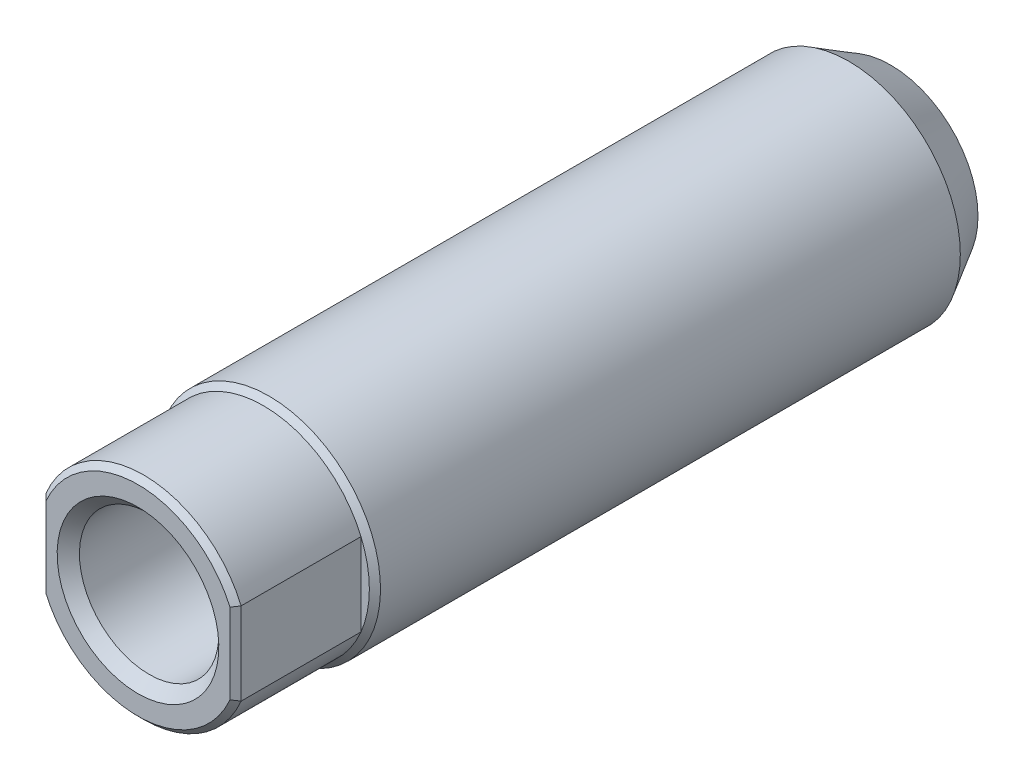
ISO-10303-21;
HEADER;
FILE_DESCRIPTION(('STEP AP214'),'2;1');
FILE_NAME('part.step','',(''),(''),'','','');
FILE_SCHEMA(('AUTOMOTIVE_DESIGN { 1 0 10303 214 1 1 1 1 }'));
ENDSEC;
DATA;
#1=APPLICATION_CONTEXT('core data for automotive mechanical design processes');
#2=APPLICATION_PROTOCOL_DEFINITION('international standard','automotive_design',2000,#1);
#3=PRODUCT_CONTEXT('',#1,'mechanical');
#4=PRODUCT('Part','Part','',(#3));
#5=PRODUCT_RELATED_PRODUCT_CATEGORY('part','',(#4));
#6=PRODUCT_DEFINITION_FORMATION('','',#4);
#7=PRODUCT_DEFINITION_CONTEXT('part definition',#1,'design');
#8=PRODUCT_DEFINITION('design','',#6,#7);
#9=PRODUCT_DEFINITION_SHAPE('','',#8);
#10=(LENGTH_UNIT() NAMED_UNIT(*) SI_UNIT(.MILLI.,.METRE.));
#11=(NAMED_UNIT(*) PLANE_ANGLE_UNIT() SI_UNIT($,.RADIAN.));
#12=(NAMED_UNIT(*) SI_UNIT($,.STERADIAN.) SOLID_ANGLE_UNIT());
#13=UNCERTAINTY_MEASURE_WITH_UNIT(LENGTH_MEASURE(1.E-05),#10,'distance_accuracy_value','');
#14=(GEOMETRIC_REPRESENTATION_CONTEXT(3) GLOBAL_UNCERTAINTY_ASSIGNED_CONTEXT((#13)) GLOBAL_UNIT_ASSIGNED_CONTEXT((#10,
#11,#12)) REPRESENTATION_CONTEXT('',''));
#15=CARTESIAN_POINT('',(0.,0.,0.));
#16=DIRECTION('',(0.,0.,1.));
#17=DIRECTION('',(1.,0.,0.));
#18=AXIS2_PLACEMENT_3D('',#15,#16,#17);
#19=CARTESIAN_POINT('',(0.,0.,27.));
#20=DIRECTION('',(0.,0.,-1.));
#21=DIRECTION('',(0.,1.,0.));
#22=AXIS2_PLACEMENT_3D('',#19,#20,#21);
#23=CYLINDRICAL_SURFACE('',#22,4.);
#24=CARTESIAN_POINT('',(0.,0.,1.5));
#25=DIRECTION('',(0.,0.,1.));
#26=DIRECTION('',(0.,-1.,0.));
#27=AXIS2_PLACEMENT_3D('',#24,#25,#26);
#28=CIRCLE('',#27,4.);
#29=CARTESIAN_POINT('',(0.,-4.,1.5));
#30=VERTEX_POINT('',#29);
#31=EDGE_CURVE('E23',#30,#30,#28,.T.);
#32=ORIENTED_EDGE('',*,*,#31,.T.);
#33=EDGE_LOOP('',(#32));
#34=FACE_BOUND('',#33,.T.);
#35=CARTESIAN_POINT('',(0.,0.,22.3));
#36=DIRECTION('',(0.,0.,-1.));
#37=DIRECTION('',(0.,1.,0.));
#38=AXIS2_PLACEMENT_3D('',#35,#36,#37);
#39=CIRCLE('',#38,4.);
#40=CARTESIAN_POINT('',(0.,4.,22.3));
#41=VERTEX_POINT('',#40);
#42=EDGE_CURVE('E100',#41,#41,#39,.T.);
#43=ORIENTED_EDGE('',*,*,#42,.T.);
#44=EDGE_LOOP('',(#43));
#45=FACE_BOUND('',#44,.T.);
#46=ADVANCED_FACE('F14',(#34,#45),#23,.T.);
#47=CARTESIAN_POINT('',(0.,0.,0.));
#48=DIRECTION('',(0.,0.,1.));
#49=DIRECTION('',(0.,-1.,0.));
#50=AXIS2_PLACEMENT_3D('',#47,#48,#49);
#51=PLANE('',#50);
#52=CARTESIAN_POINT('',(0.,0.,0.));
#53=DIRECTION('',(0.,0.,1.));
#54=DIRECTION('',(0.,-1.,0.));
#55=AXIS2_PLACEMENT_3D('',#52,#53,#54);
#56=CIRCLE('',#55,3.13397459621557);
#57=CARTESIAN_POINT('',(0.,-3.13397459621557,0.));
#58=VERTEX_POINT('',#57);
#59=EDGE_CURVE('E9',#58,#58,#56,.F.);
#60=ORIENTED_EDGE('',*,*,#59,.T.);
#61=EDGE_LOOP('',(#60));
#62=FACE_BOUND('',#61,.T.);
#63=ADVANCED_FACE('F183',(#62),#51,.F.);
#64=CARTESIAN_POINT('',(0.,0.,22.5));
#65=DIRECTION('',(0.,0.,-1.));
#66=DIRECTION('',(0.,1.,0.));
#67=AXIS2_PLACEMENT_3D('',#64,#65,#66);
#68=CONICAL_SURFACE('',#67,3.8,0.785398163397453);
#69=CARTESIAN_POINT('',(0.,0.,22.5));
#70=DIRECTION('',(0.,0.,-1.));
#71=DIRECTION('',(0.,1.,0.));
#72=AXIS2_PLACEMENT_3D('',#69,#70,#71);
#73=CIRCLE('',#72,3.8);
#74=CARTESIAN_POINT('',(3.5,1.47986485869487,22.5));
#75=VERTEX_POINT('',#74);
#76=CARTESIAN_POINT('',(3.5,-1.47986485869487,22.5));
#77=VERTEX_POINT('',#76);
#78=EDGE_CURVE('E74',#75,#77,#73,.T.);
#79=ORIENTED_EDGE('',*,*,#78,.T.);
#80=CARTESIAN_POINT('',(-3.5,-1.47986485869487,22.5));
#81=VERTEX_POINT('',#80);
#82=EDGE_CURVE('E91',#77,#81,#73,.T.);
#83=ORIENTED_EDGE('',*,*,#82,.T.);
#84=CARTESIAN_POINT('',(-3.5,1.47986485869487,22.5));
#85=VERTEX_POINT('',#84);
#86=EDGE_CURVE('E85',#81,#85,#73,.T.);
#87=ORIENTED_EDGE('',*,*,#86,.T.);
#88=EDGE_CURVE('E70',#85,#75,#73,.T.);
#89=ORIENTED_EDGE('',*,*,#88,.T.);
#90=EDGE_LOOP('',(#79,#83,#87,#89));
#91=FACE_BOUND('',#90,.T.);
#92=ORIENTED_EDGE('',*,*,#42,.F.);
#93=EDGE_LOOP('',(#92));
#94=FACE_BOUND('',#93,.T.);
#95=ADVANCED_FACE('F80',(#91,#94),#68,.T.);
#96=CARTESIAN_POINT('',(0.,0.,0.));
#97=DIRECTION('',(0.,0.,-1.));
#98=DIRECTION('',(0.,1.,0.));
#99=AXIS2_PLACEMENT_3D('',#96,#97,#98);
#100=CYLINDRICAL_SURFACE('',#99,3.8);
#101=DIRECTION('',(0.,0.,-1.));
#102=VECTOR('',#101,1.);
#103=CARTESIAN_POINT('',(3.5,-1.47986485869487,0.));
#104=LINE('',#103,#102);
#105=CARTESIAN_POINT('',(3.5,-1.47986485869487,26.8));
#106=VERTEX_POINT('',#105);
#107=EDGE_CURVE('E73',#106,#77,#104,.T.);
#108=ORIENTED_EDGE('',*,*,#107,.F.);
#109=CARTESIAN_POINT('',(0.,0.,26.8));
#110=DIRECTION('',(0.,0.,1.));
#111=DIRECTION('',(0.,-1.,0.));
#112=AXIS2_PLACEMENT_3D('',#109,#110,#111);
#113=CIRCLE('',#112,3.8);
#114=CARTESIAN_POINT('',(-3.5,-1.47986485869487,26.8));
#115=VERTEX_POINT('',#114);
#116=EDGE_CURVE('E118',#106,#115,#113,.F.);
#117=ORIENTED_EDGE('',*,*,#116,.T.);
#118=DIRECTION('',(0.,0.,-1.));
#119=VECTOR('',#118,1.);
#120=CARTESIAN_POINT('',(-3.5,-1.47986485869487,0.));
#121=LINE('',#120,#119);
#122=EDGE_CURVE('E97',#81,#115,#121,.F.);
#123=ORIENTED_EDGE('',*,*,#122,.F.);
#124=ORIENTED_EDGE('',*,*,#82,.F.);
#125=EDGE_LOOP('',(#108,#117,#123,#124));
#126=FACE_BOUND('',#125,.T.);
#127=ADVANCED_FACE('F210',(#126),#100,.T.);
#128=DIRECTION('',(0.,0.,-1.));
#129=VECTOR('',#128,1.);
#130=CARTESIAN_POINT('',(-3.5,1.47986485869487,0.));
#131=LINE('',#130,#129);
#132=CARTESIAN_POINT('',(-3.5,1.47986485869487,26.8));
#133=VERTEX_POINT('',#132);
#134=EDGE_CURVE('E94',#133,#85,#131,.T.);
#135=ORIENTED_EDGE('',*,*,#134,.F.);
#136=CARTESIAN_POINT('',(0.,0.,26.8));
#137=DIRECTION('',(0.,0.,1.));
#138=DIRECTION('',(0.,-1.,0.));
#139=AXIS2_PLACEMENT_3D('',#136,#137,#138);
#140=CIRCLE('',#139,3.8);
#141=CARTESIAN_POINT('',(3.5,1.47986485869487,26.8));
#142=VERTEX_POINT('',#141);
#143=EDGE_CURVE('E30',#133,#142,#140,.F.);
#144=ORIENTED_EDGE('',*,*,#143,.T.);
#145=DIRECTION('',(0.,0.,-1.));
#146=VECTOR('',#145,1.);
#147=CARTESIAN_POINT('',(3.5,1.47986485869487,0.));
#148=LINE('',#147,#146);
#149=EDGE_CURVE('E67',#75,#142,#148,.F.);
#150=ORIENTED_EDGE('',*,*,#149,.F.);
#151=ORIENTED_EDGE('',*,*,#88,.F.);
#152=EDGE_LOOP('',(#135,#144,#150,#151));
#153=FACE_BOUND('',#152,.T.);
#154=ADVANCED_FACE('F69',(#153),#100,.T.);
#155=CARTESIAN_POINT('',(3.5,5.,27.5));
#156=DIRECTION('',(-1.,0.,0.));
#157=DIRECTION('',(0.,0.,-1.));
#158=AXIS2_PLACEMENT_3D('',#155,#156,#157);
#159=PLANE('',#158);
#160=ORIENTED_EDGE('',*,*,#149,.T.);
#161=DIRECTION('',(0.,-1.,0.));
#162=VECTOR('',#161,1.);
#163=CARTESIAN_POINT('',(3.5,-1.47986485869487,26.8));
#164=LINE('',#163,#162);
#165=EDGE_CURVE('E37',#142,#106,#164,.T.);
#166=ORIENTED_EDGE('',*,*,#165,.T.);
#167=ORIENTED_EDGE('',*,*,#107,.T.);
#168=DIRECTION('',(0.,-1.,0.));
#169=VECTOR('',#168,1.);
#170=CARTESIAN_POINT('',(3.5,5.,22.5));
#171=LINE('',#170,#169);
#172=EDGE_CURVE('E90',#75,#77,#171,.T.);
#173=ORIENTED_EDGE('',*,*,#172,.F.);
#174=EDGE_LOOP('',(#160,#166,#167,#173));
#175=FACE_BOUND('',#174,.T.);
#176=ADVANCED_FACE('F92',(#175),#159,.F.);
#177=CARTESIAN_POINT('',(3.5,5.,22.5));
#178=DIRECTION('',(0.,0.,-1.));
#179=DIRECTION('',(0.,1.,0.));
#180=AXIS2_PLACEMENT_3D('',#177,#178,#179);
#181=PLANE('',#180);
#182=ORIENTED_EDGE('',*,*,#172,.T.);
#183=ORIENTED_EDGE('',*,*,#78,.F.);
#184=EDGE_LOOP('',(#182,#183));
#185=FACE_BOUND('',#184,.T.);
#186=ADVANCED_FACE('F89',(#185),#181,.F.);
#187=CARTESIAN_POINT('',(-3.5,5.,27.5));
#188=DIRECTION('',(1.,0.,0.));
#189=DIRECTION('',(0.,0.,1.));
#190=AXIS2_PLACEMENT_3D('',#187,#188,#189);
#191=PLANE('',#190);
#192=ORIENTED_EDGE('',*,*,#122,.T.);
#193=DIRECTION('',(0.,1.,0.));
#194=VECTOR('',#193,1.);
#195=CARTESIAN_POINT('',(-3.5,1.47986485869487,26.8));
#196=LINE('',#195,#194);
#197=EDGE_CURVE('E106',#115,#133,#196,.T.);
#198=ORIENTED_EDGE('',*,*,#197,.T.);
#199=ORIENTED_EDGE('',*,*,#134,.T.);
#200=DIRECTION('',(0.,-1.,0.));
#201=VECTOR('',#200,1.);
#202=CARTESIAN_POINT('',(-3.5,5.,22.5));
#203=LINE('',#202,#201);
#204=EDGE_CURVE('E95',#85,#81,#203,.T.);
#205=ORIENTED_EDGE('',*,*,#204,.T.);
#206=EDGE_LOOP('',(#192,#198,#199,#205));
#207=FACE_BOUND('',#206,.T.);
#208=ADVANCED_FACE('F201',(#207),#191,.F.);
#209=CARTESIAN_POINT('',(-4.5,5.,22.5));
#210=DIRECTION('',(0.,0.,-1.));
#211=DIRECTION('',(0.,1.,0.));
#212=AXIS2_PLACEMENT_3D('',#209,#210,#211);
#213=PLANE('',#212);
#214=ORIENTED_EDGE('',*,*,#204,.F.);
#215=ORIENTED_EDGE('',*,*,#86,.F.);
#216=EDGE_LOOP('',(#214,#215));
#217=FACE_BOUND('',#216,.T.);
#218=ADVANCED_FACE('F195',(#217),#213,.F.);
#219=CARTESIAN_POINT('',(0.,0.,27.));
#220=DIRECTION('',(0.,0.,1.));
#221=DIRECTION('',(0.,-1.,0.));
#222=AXIS2_PLACEMENT_3D('',#219,#220,#221);
#223=PLANE('',#222);
#224=CARTESIAN_POINT('',(0.,0.,27.));
#225=DIRECTION('',(0.,0.,1.));
#226=DIRECTION('',(0.,-1.,0.));
#227=AXIS2_PLACEMENT_3D('',#224,#225,#226);
#228=CIRCLE('',#227,3.6);
#229=CARTESIAN_POINT('',(3.3,1.43874945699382,27.));
#230=VERTEX_POINT('',#229);
#231=CARTESIAN_POINT('',(-3.3,1.43874945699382,27.));
#232=VERTEX_POINT('',#231);
#233=EDGE_CURVE('E109',#230,#232,#228,.T.);
#234=ORIENTED_EDGE('',*,*,#233,.T.);
#235=DIRECTION('',(0.,-1.,0.));
#236=VECTOR('',#235,1.);
#237=CARTESIAN_POINT('',(-3.3,-1.47986485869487,27.));
#238=LINE('',#237,#236);
#239=CARTESIAN_POINT('',(-3.3,-1.43874945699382,27.));
#240=VERTEX_POINT('',#239);
#241=EDGE_CURVE('E115',#232,#240,#238,.T.);
#242=ORIENTED_EDGE('',*,*,#241,.T.);
#243=CARTESIAN_POINT('',(0.,0.,27.));
#244=DIRECTION('',(0.,0.,1.));
#245=DIRECTION('',(0.,-1.,0.));
#246=AXIS2_PLACEMENT_3D('',#243,#244,#245);
#247=CIRCLE('',#246,3.6);
#248=CARTESIAN_POINT('',(3.3,-1.43874945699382,27.));
#249=VERTEX_POINT('',#248);
#250=EDGE_CURVE('E113',#240,#249,#247,.T.);
#251=ORIENTED_EDGE('',*,*,#250,.T.);
#252=DIRECTION('',(0.,1.,0.));
#253=VECTOR('',#252,1.);
#254=CARTESIAN_POINT('',(3.3,1.47986485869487,27.));
#255=LINE('',#254,#253);
#256=EDGE_CURVE('E111',#249,#230,#255,.T.);
#257=ORIENTED_EDGE('',*,*,#256,.T.);
#258=EDGE_LOOP('',(#234,#242,#251,#257));
#259=FACE_BOUND('',#258,.T.);
#260=CARTESIAN_POINT('',(0.,0.,27.));
#261=DIRECTION('',(0.,0.,1.));
#262=DIRECTION('',(0.,-1.,0.));
#263=AXIS2_PLACEMENT_3D('',#260,#261,#262);
#264=CIRCLE('',#263,2.9);
#265=CARTESIAN_POINT('',(0.,-2.9,27.));
#266=VERTEX_POINT('',#265);
#267=EDGE_CURVE('E86',#266,#266,#264,.T.);
#268=ORIENTED_EDGE('',*,*,#267,.F.);
#269=EDGE_LOOP('',(#268));
#270=FACE_BOUND('',#269,.T.);
#271=ADVANCED_FACE('F191',(#259,#270),#223,.T.);
#272=CARTESIAN_POINT('',(0.,0.,27.));
#273=DIRECTION('',(0.,0.,1.));
#274=DIRECTION('',(0.,-1.,0.));
#275=AXIS2_PLACEMENT_3D('',#272,#273,#274);
#276=CONICAL_SURFACE('',#275,2.9,0.78539816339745);
#277=CARTESIAN_POINT('',(0.,0.,26.6));
#278=DIRECTION('',(0.,0.,1.));
#279=DIRECTION('',(0.,-1.,0.));
#280=AXIS2_PLACEMENT_3D('',#277,#278,#279);
#281=CIRCLE('',#280,2.5);
#282=CARTESIAN_POINT('',(0.,-2.5,26.6));
#283=VERTEX_POINT('',#282);
#284=EDGE_CURVE('E18',#283,#283,#281,.F.);
#285=ORIENTED_EDGE('',*,*,#284,.T.);
#286=EDGE_LOOP('',(#285));
#287=FACE_BOUND('',#286,.T.);
#288=ORIENTED_EDGE('',*,*,#267,.T.);
#289=EDGE_LOOP('',(#288));
#290=FACE_BOUND('',#289,.T.);
#291=ADVANCED_FACE('F194',(#287,#290),#276,.F.);
#292=CARTESIAN_POINT('',(3.5,5.,26.8));
#293=DIRECTION('',(0.707106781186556,0.,0.707106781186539));
#294=DIRECTION('',(-0.707106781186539,0.,0.707106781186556));
#295=AXIS2_PLACEMENT_3D('',#292,#293,#294);
#296=PLANE('',#295);
#297=CARTESIAN_POINT('',(3.3,1.43874945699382,27.));
#298=CARTESIAN_POINT('',(3.33332361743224,1.44569655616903,26.9666763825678));
#299=CARTESIAN_POINT('',(3.36665209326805,1.45259638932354,26.933347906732));
#300=CARTESIAN_POINT('',(3.43331875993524,1.46630152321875,26.8666812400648));
#301=CARTESIAN_POINT('',(3.4666569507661,1.4731068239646,26.8333430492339));
#302=CARTESIAN_POINT('',(3.5,1.47986485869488,26.8));
#303=B_SPLINE_CURVE_WITH_KNOTS('',3,(#297,#298,#299,#300,#301,#302),.UNSPECIFIED.,.F.,.F.,(4,2,
4),(0.,0.142907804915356,0.285815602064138),.UNSPECIFIED.);
#304=EDGE_CURVE('E160',#230,#142,#303,.T.);
#305=ORIENTED_EDGE('',*,*,#304,.F.);
#306=ORIENTED_EDGE('',*,*,#256,.F.);
#307=CARTESIAN_POINT('',(3.3,-1.43874945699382,27.));
#308=CARTESIAN_POINT('',(3.33332361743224,-1.44569655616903,26.9666763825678));
#309=CARTESIAN_POINT('',(3.36665209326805,-1.45259638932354,26.933347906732));
#310=CARTESIAN_POINT('',(3.43331875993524,-1.46630152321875,26.8666812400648));
#311=CARTESIAN_POINT('',(3.4666569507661,-1.4731068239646,26.8333430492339));
#312=CARTESIAN_POINT('',(3.5,-1.47986485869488,26.8));
#313=B_SPLINE_CURVE_WITH_KNOTS('',3,(#307,#308,#309,#310,#311,#312),.UNSPECIFIED.,.F.,.F.,(4,2,
4),(0.,0.142907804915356,0.285815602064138),.UNSPECIFIED.);
#314=EDGE_CURVE('E153',#106,#249,#313,.F.);
#315=ORIENTED_EDGE('',*,*,#314,.F.);
#316=ORIENTED_EDGE('',*,*,#165,.F.);
#317=EDGE_LOOP('',(#305,#306,#315,#316));
#318=FACE_BOUND('',#317,.T.);
#319=ADVANCED_FACE('F148',(#318),#296,.T.);
#320=CARTESIAN_POINT('',(0.,0.,26.8));
#321=DIRECTION('',(0.,0.,-1.));
#322=DIRECTION('',(0.,1.,0.));
#323=AXIS2_PLACEMENT_3D('',#320,#321,#322);
#324=CONICAL_SURFACE('',#323,3.8,0.785398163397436);
#325=ORIENTED_EDGE('',*,*,#314,.T.);
#326=ORIENTED_EDGE('',*,*,#250,.F.);
#327=CARTESIAN_POINT('',(-3.3,-1.43874945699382,27.));
#328=CARTESIAN_POINT('',(-3.33332361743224,-1.44569655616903,26.9666763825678));
#329=CARTESIAN_POINT('',(-3.36665209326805,-1.45259638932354,26.933347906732));
#330=CARTESIAN_POINT('',(-3.43331875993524,-1.46630152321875,26.8666812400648));
#331=CARTESIAN_POINT('',(-3.4666569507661,-1.4731068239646,26.8333430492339));
#332=CARTESIAN_POINT('',(-3.5,-1.47986485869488,26.8));
#333=B_SPLINE_CURVE_WITH_KNOTS('',3,(#327,#328,#329,#330,#331,#332),.UNSPECIFIED.,.F.,.F.,(4,2,
4),(0.,0.142907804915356,0.285815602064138),.UNSPECIFIED.);
#334=EDGE_CURVE('E130',#115,#240,#333,.F.);
#335=ORIENTED_EDGE('',*,*,#334,.F.);
#336=ORIENTED_EDGE('',*,*,#116,.F.);
#337=EDGE_LOOP('',(#325,#326,#335,#336));
#338=FACE_BOUND('',#337,.T.);
#339=ADVANCED_FACE('F144',(#338),#324,.T.);
#340=CARTESIAN_POINT('',(0.,0.,26.8));
#341=DIRECTION('',(0.,0.,-1.));
#342=DIRECTION('',(0.,1.,0.));
#343=AXIS2_PLACEMENT_3D('',#340,#341,#342);
#344=CONICAL_SURFACE('',#343,3.8,0.785398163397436);
#345=ORIENTED_EDGE('',*,*,#304,.T.);
#346=ORIENTED_EDGE('',*,*,#143,.F.);
#347=CARTESIAN_POINT('',(-3.5,1.47986485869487,26.8));
#348=CARTESIAN_POINT('',(-3.4666569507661,1.47310682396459,26.8333430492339));
#349=CARTESIAN_POINT('',(-3.43331875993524,1.46630152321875,26.8666812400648));
#350=CARTESIAN_POINT('',(-3.36665209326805,1.45259638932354,26.933347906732));
#351=CARTESIAN_POINT('',(-3.33332361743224,1.44569655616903,26.9666763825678));
#352=CARTESIAN_POINT('',(-3.3,1.43874945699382,27.));
#353=B_SPLINE_CURVE_WITH_KNOTS('',3,(#347,#348,#349,#350,#351,#352),.UNSPECIFIED.,.F.,.F.,(4,2,
4),(0.,0.142907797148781,0.285815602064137),.UNSPECIFIED.);
#354=EDGE_CURVE('E122',#232,#133,#353,.F.);
#355=ORIENTED_EDGE('',*,*,#354,.F.);
#356=ORIENTED_EDGE('',*,*,#233,.F.);
#357=EDGE_LOOP('',(#345,#346,#355,#356));
#358=FACE_BOUND('',#357,.T.);
#359=ADVANCED_FACE('F137',(#358),#344,.T.);
#360=CARTESIAN_POINT('',(-3.5,5.,26.8));
#361=DIRECTION('',(-0.707106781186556,0.,0.707106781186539));
#362=DIRECTION('',(-0.707106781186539,0.,-0.707106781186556));
#363=AXIS2_PLACEMENT_3D('',#360,#361,#362);
#364=PLANE('',#363);
#365=ORIENTED_EDGE('',*,*,#334,.T.);
#366=ORIENTED_EDGE('',*,*,#241,.F.);
#367=ORIENTED_EDGE('',*,*,#354,.T.);
#368=ORIENTED_EDGE('',*,*,#197,.F.);
#369=EDGE_LOOP('',(#365,#366,#367,#368));
#370=FACE_BOUND('',#369,.T.);
#371=ADVANCED_FACE('F140',(#370),#364,.T.);
#372=CARTESIAN_POINT('',(0.,0.,1.5));
#373=DIRECTION('',(0.,0.,1.));
#374=DIRECTION('',(0.,-1.,0.));
#375=AXIS2_PLACEMENT_3D('',#372,#373,#374);
#376=CONICAL_SURFACE('',#375,4.,0.523598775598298);
#377=ORIENTED_EDGE('',*,*,#59,.F.);
#378=EDGE_LOOP('',(#377));
#379=FACE_BOUND('',#378,.T.);
#380=ORIENTED_EDGE('',*,*,#31,.F.);
#381=EDGE_LOOP('',(#380));
#382=FACE_BOUND('',#381,.T.);
#383=ADVANCED_FACE('F16',(#379,#382),#376,.T.);
#384=CARTESIAN_POINT('',(0.,0.,17.));
#385=DIRECTION('',(0.,0.,1.));
#386=DIRECTION('',(0.,-1.,0.));
#387=AXIS2_PLACEMENT_3D('',#384,#385,#386);
#388=PLANE('',#387);
#389=CARTESIAN_POINT('',(0.,0.,17.));
#390=DIRECTION('',(0.,0.,1.));
#391=DIRECTION('',(0.,-1.,0.));
#392=AXIS2_PLACEMENT_3D('',#389,#390,#391);
#393=CIRCLE('',#392,2.5);
#394=CARTESIAN_POINT('',(0.,-2.5,17.));
#395=VERTEX_POINT('',#394);
#396=EDGE_CURVE('E225',#395,#395,#393,.T.);
#397=ORIENTED_EDGE('',*,*,#396,.T.);
#398=EDGE_LOOP('',(#397));
#399=FACE_BOUND('',#398,.T.);
#400=ADVANCED_FACE('F171',(#399),#388,.T.);
#401=CARTESIAN_POINT('',(0.,0.,17.));
#402=DIRECTION('',(0.,0.,1.));
#403=DIRECTION('',(0.,-1.,0.));
#404=AXIS2_PLACEMENT_3D('',#401,#402,#403);
#405=CYLINDRICAL_SURFACE('',#404,2.5);
#406=ORIENTED_EDGE('',*,*,#396,.F.);
#407=EDGE_LOOP('',(#406));
#408=FACE_BOUND('',#407,.T.);
#409=ORIENTED_EDGE('',*,*,#284,.F.);
#410=EDGE_LOOP('',(#409));
#411=FACE_BOUND('',#410,.T.);
#412=ADVANCED_FACE('F178',(#408,#411),#405,.F.);
#413=CLOSED_SHELL('',(#46,#63,#95,#127,#154,#176,#186,#208,#218,#271,#291,#319,#339,#359,#371,
#383,#400,#412));
#414=MANIFOLD_SOLID_BREP('B1',#413);
#415=ADVANCED_BREP_SHAPE_REPRESENTATION('',(#18,#414),#14);
#416=SHAPE_DEFINITION_REPRESENTATION(#9,#415);
ENDSEC;
END-ISO-10303-21;
